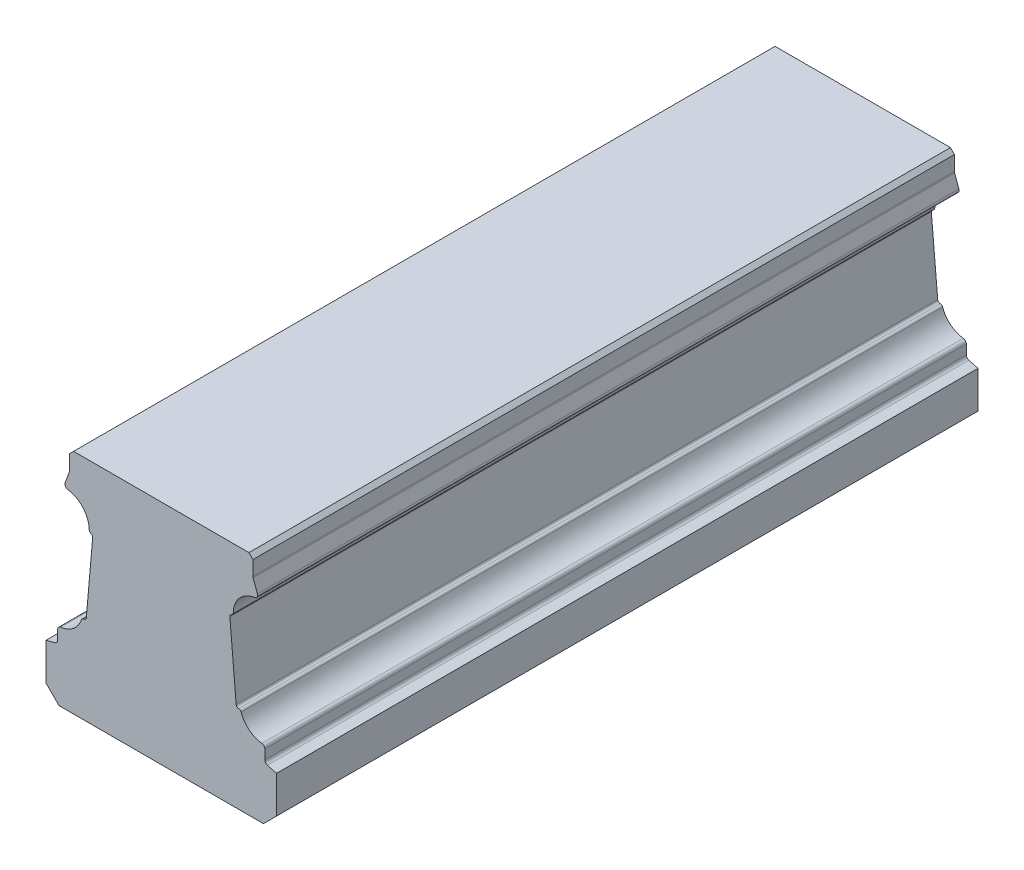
ISO-10303-21;
HEADER;
FILE_DESCRIPTION(('STEP AP214'),'2;1');
FILE_NAME('part.step','',(''),(''),'','','');
FILE_SCHEMA(('AUTOMOTIVE_DESIGN { 1 0 10303 214 1 1 1 1 }'));
ENDSEC;
DATA;
#1=APPLICATION_CONTEXT('core data for automotive mechanical design processes');
#2=APPLICATION_PROTOCOL_DEFINITION('international standard','automotive_design',2000,#1);
#3=PRODUCT_CONTEXT('',#1,'mechanical');
#4=PRODUCT('Part','Part','',(#3));
#5=PRODUCT_RELATED_PRODUCT_CATEGORY('part','',(#4));
#6=PRODUCT_DEFINITION_FORMATION('','',#4);
#7=PRODUCT_DEFINITION_CONTEXT('part definition',#1,'design');
#8=PRODUCT_DEFINITION('design','',#6,#7);
#9=PRODUCT_DEFINITION_SHAPE('','',#8);
#10=(LENGTH_UNIT() NAMED_UNIT(*) SI_UNIT(.MILLI.,.METRE.));
#11=(NAMED_UNIT(*) PLANE_ANGLE_UNIT() SI_UNIT($,.RADIAN.));
#12=(NAMED_UNIT(*) SI_UNIT($,.STERADIAN.) SOLID_ANGLE_UNIT());
#13=UNCERTAINTY_MEASURE_WITH_UNIT(LENGTH_MEASURE(1.E-05),#10,'distance_accuracy_value','');
#14=(GEOMETRIC_REPRESENTATION_CONTEXT(3) GLOBAL_UNCERTAINTY_ASSIGNED_CONTEXT((#13)) GLOBAL_UNIT_ASSIGNED_CONTEXT((#10,
#11,#12)) REPRESENTATION_CONTEXT('',''));
#15=CARTESIAN_POINT('',(0.,0.,0.));
#16=DIRECTION('',(0.,0.,1.));
#17=DIRECTION('',(1.,0.,0.));
#18=AXIS2_PLACEMENT_3D('',#15,#16,#17);
#19=CARTESIAN_POINT('',(-7.72739877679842,8.44692415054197,70.));
#20=DIRECTION('',(0.,0.,-1.));
#21=DIRECTION('',(-1.,0.,0.));
#22=AXIS2_PLACEMENT_3D('',#19,#20,#21);
#23=CYLINDRICAL_SURFACE('',#22,0.257);
#24=CARTESIAN_POINT('',(-7.72739877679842,8.44692415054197,0.));
#25=DIRECTION('',(0.,0.,1.));
#26=DIRECTION('',(1.,0.,0.));
#27=AXIS2_PLACEMENT_3D('',#24,#25,#26);
#28=CIRCLE('',#27,0.257);
#29=CARTESIAN_POINT('',(-7.73119938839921,8.70389604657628,0.));
#30=VERTEX_POINT('',#29);
#31=CARTESIAN_POINT('',(-7.97114777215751,8.52838228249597,0.));
#32=VERTEX_POINT('',#31);
#33=EDGE_CURVE('E316',#30,#32,#28,.T.);
#34=ORIENTED_EDGE('',*,*,#33,.T.);
#35=DIRECTION('',(0.,0.,-1.));
#36=VECTOR('',#35,1.);
#37=CARTESIAN_POINT('',(-7.97114777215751,8.52838228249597,70.));
#38=LINE('',#37,#36);
#39=CARTESIAN_POINT('',(-7.97114777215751,8.52838228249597,70.));
#40=VERTEX_POINT('',#39);
#41=EDGE_CURVE('E11',#40,#32,#38,.T.);
#42=ORIENTED_EDGE('',*,*,#41,.F.);
#43=CARTESIAN_POINT('',(-7.72739877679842,8.44692415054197,70.));
#44=DIRECTION('',(0.,0.,1.));
#45=DIRECTION('',(1.,0.,0.));
#46=AXIS2_PLACEMENT_3D('',#43,#44,#45);
#47=CIRCLE('',#46,0.257);
#48=CARTESIAN_POINT('',(-7.73119938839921,8.70389604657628,70.));
#49=VERTEX_POINT('',#48);
#50=EDGE_CURVE('E391',#49,#40,#47,.T.);
#51=ORIENTED_EDGE('',*,*,#50,.F.);
#52=DIRECTION('',(0.,0.,-1.));
#53=VECTOR('',#52,1.);
#54=CARTESIAN_POINT('',(-7.73119938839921,8.70389604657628,70.));
#55=LINE('',#54,#53);
#56=EDGE_CURVE('E312',#49,#30,#55,.T.);
#57=ORIENTED_EDGE('',*,*,#56,.T.);
#58=EDGE_LOOP('',(#34,#42,#51,#57));
#59=FACE_BOUND('',#58,.T.);
#60=ADVANCED_FACE('F40',(#59),#23,.T.);
#61=CARTESIAN_POINT('',(-10.31,9.31,70.));
#62=DIRECTION('',(0.,0.,-1.));
#63=DIRECTION('',(-1.,0.,0.));
#64=AXIS2_PLACEMENT_3D('',#61,#62,#63);
#65=CYLINDRICAL_SURFACE('',#64,2.466);
#66=CARTESIAN_POINT('',(-10.31,9.31,0.));
#67=DIRECTION('',(0.,0.,-1.));
#68=DIRECTION('',(-1.,0.,0.));
#69=AXIS2_PLACEMENT_3D('',#66,#67,#68);
#70=CIRCLE('',#69,2.466);
#71=CARTESIAN_POINT('',(-10.0308301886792,6.85985302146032,0.));
#72=VERTEX_POINT('',#71);
#73=EDGE_CURVE('E319',#32,#72,#70,.T.);
#74=ORIENTED_EDGE('',*,*,#73,.T.);
#75=DIRECTION('',(0.,0.,-1.));
#76=VECTOR('',#75,1.);
#77=CARTESIAN_POINT('',(-10.0308301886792,6.85985302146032,70.));
#78=LINE('',#77,#76);
#79=CARTESIAN_POINT('',(-10.0308301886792,6.85985302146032,70.));
#80=VERTEX_POINT('',#79);
#81=EDGE_CURVE('E48',#80,#72,#78,.T.);
#82=ORIENTED_EDGE('',*,*,#81,.F.);
#83=CARTESIAN_POINT('',(-10.31,9.31,70.));
#84=DIRECTION('',(0.,0.,-1.));
#85=DIRECTION('',(-1.,0.,0.));
#86=AXIS2_PLACEMENT_3D('',#83,#84,#85);
#87=CIRCLE('',#86,2.466);
#88=EDGE_CURVE('E189',#40,#80,#87,.T.);
#89=ORIENTED_EDGE('',*,*,#88,.F.);
#90=ORIENTED_EDGE('',*,*,#41,.T.);
#91=EDGE_LOOP('',(#74,#82,#89,#90));
#92=FACE_BOUND('',#91,.T.);
#93=ADVANCED_FACE('F599',(#92),#65,.F.);
#94=CARTESIAN_POINT('',(-9.992,6.5190580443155,70.));
#95=DIRECTION('',(0.,0.,-1.));
#96=DIRECTION('',(-1.,0.,0.));
#97=AXIS2_PLACEMENT_3D('',#94,#95,#96);
#98=CYLINDRICAL_SURFACE('',#97,0.343000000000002);
#99=CARTESIAN_POINT('',(-9.992,6.5190580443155,0.));
#100=DIRECTION('',(0.,0.,1.));
#101=DIRECTION('',(1.,0.,0.));
#102=AXIS2_PLACEMENT_3D('',#99,#100,#101);
#103=CIRCLE('',#102,0.343000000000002);
#104=CARTESIAN_POINT('',(-10.335,6.5190580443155,0.));
#105=VERTEX_POINT('',#104);
#106=EDGE_CURVE('E321',#72,#105,#103,.T.);
#107=ORIENTED_EDGE('',*,*,#106,.T.);
#108=DIRECTION('',(0.,0.,-1.));
#109=VECTOR('',#108,1.);
#110=CARTESIAN_POINT('',(-10.335,6.5190580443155,70.));
#111=LINE('',#110,#109);
#112=CARTESIAN_POINT('',(-10.335,6.5190580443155,70.));
#113=VERTEX_POINT('',#112);
#114=EDGE_CURVE('E488',#113,#105,#111,.T.);
#115=ORIENTED_EDGE('',*,*,#114,.F.);
#116=CARTESIAN_POINT('',(-9.992,6.5190580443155,70.));
#117=DIRECTION('',(0.,0.,1.));
#118=DIRECTION('',(1.,0.,0.));
#119=AXIS2_PLACEMENT_3D('',#116,#117,#118);
#120=CIRCLE('',#119,0.343000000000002);
#121=EDGE_CURVE('E496',#80,#113,#120,.T.);
#122=ORIENTED_EDGE('',*,*,#121,.F.);
#123=ORIENTED_EDGE('',*,*,#81,.T.);
#124=EDGE_LOOP('',(#107,#115,#122,#123));
#125=FACE_BOUND('',#124,.T.);
#126=ADVANCED_FACE('F494',(#125),#98,.T.);
#127=CARTESIAN_POINT('',(-10.335,5.57535396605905,70.));
#128=DIRECTION('',(1.,0.,0.));
#129=DIRECTION('',(0.,1.,0.));
#130=AXIS2_PLACEMENT_3D('',#127,#128,#129);
#131=PLANE('',#130);
#132=DIRECTION('',(0.,-1.,0.));
#133=VECTOR('',#132,1.);
#134=CARTESIAN_POINT('',(-10.335,5.57535396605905,0.));
#135=LINE('',#134,#133);
#136=CARTESIAN_POINT('',(-10.335,5.57535396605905,0.));
#137=VERTEX_POINT('',#136);
#138=EDGE_CURVE('E323',#105,#137,#135,.T.);
#139=ORIENTED_EDGE('',*,*,#138,.T.);
#140=DIRECTION('',(0.,0.,-1.));
#141=VECTOR('',#140,1.);
#142=CARTESIAN_POINT('',(-10.335,5.57535396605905,70.));
#143=LINE('',#142,#141);
#144=CARTESIAN_POINT('',(-10.335,5.57535396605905,70.));
#145=VERTEX_POINT('',#144);
#146=EDGE_CURVE('E485',#145,#137,#143,.T.);
#147=ORIENTED_EDGE('',*,*,#146,.F.);
#148=DIRECTION('',(0.,-1.,0.));
#149=VECTOR('',#148,1.);
#150=CARTESIAN_POINT('',(-10.335,5.57535396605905,70.));
#151=LINE('',#150,#149);
#152=EDGE_CURVE('E514',#113,#145,#151,.T.);
#153=ORIENTED_EDGE('',*,*,#152,.F.);
#154=ORIENTED_EDGE('',*,*,#114,.T.);
#155=EDGE_LOOP('',(#139,#147,#153,#154));
#156=FACE_BOUND('',#155,.T.);
#157=ADVANCED_FACE('F505',(#156),#131,.F.);
#158=CARTESIAN_POINT('',(-10.678,5.57535396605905,70.));
#159=DIRECTION('',(0.,0.,-1.));
#160=DIRECTION('',(-1.,0.,0.));
#161=AXIS2_PLACEMENT_3D('',#158,#159,#160);
#162=CYLINDRICAL_SURFACE('',#161,0.343000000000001);
#163=CARTESIAN_POINT('',(-10.678,5.57535396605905,0.));
#164=DIRECTION('',(0.,0.,-1.));
#165=DIRECTION('',(1.,0.,0.));
#166=AXIS2_PLACEMENT_3D('',#163,#164,#165);
#167=CIRCLE('',#166,0.343000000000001);
#168=CARTESIAN_POINT('',(-10.5892250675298,5.2440414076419,0.));
#169=VERTEX_POINT('',#168);
#170=EDGE_CURVE('E325',#137,#169,#167,.T.);
#171=ORIENTED_EDGE('',*,*,#170,.T.);
#172=DIRECTION('',(0.,0.,-1.));
#173=VECTOR('',#172,1.);
#174=CARTESIAN_POINT('',(-10.5892250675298,5.2440414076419,70.));
#175=LINE('',#174,#173);
#176=CARTESIAN_POINT('',(-10.5892250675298,5.2440414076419,70.));
#177=VERTEX_POINT('',#176);
#178=EDGE_CURVE('E482',#177,#169,#175,.T.);
#179=ORIENTED_EDGE('',*,*,#178,.F.);
#180=CARTESIAN_POINT('',(-10.678,5.57535396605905,70.));
#181=DIRECTION('',(0.,0.,-1.));
#182=DIRECTION('',(1.,0.,0.));
#183=AXIS2_PLACEMENT_3D('',#180,#181,#182);
#184=CIRCLE('',#183,0.343000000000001);
#185=EDGE_CURVE('E511',#145,#177,#184,.T.);
#186=ORIENTED_EDGE('',*,*,#185,.F.);
#187=ORIENTED_EDGE('',*,*,#146,.T.);
#188=EDGE_LOOP('',(#171,#179,#186,#187));
#189=FACE_BOUND('',#188,.T.);
#190=ADVANCED_FACE('F509',(#189),#162,.F.);
#191=CARTESIAN_POINT('',(-11.5,5.,70.));
#192=DIRECTION('',(0.258819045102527,-0.965925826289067,0.));
#193=DIRECTION('',(0.965925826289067,0.258819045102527,0.));
#194=AXIS2_PLACEMENT_3D('',#191,#192,#193);
#195=PLANE('',#194);
#196=DIRECTION('',(-0.965925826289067,-0.258819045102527,0.));
#197=VECTOR('',#196,1.);
#198=CARTESIAN_POINT('',(-11.5,5.,0.));
#199=LINE('',#198,#197);
#200=CARTESIAN_POINT('',(-11.5,5.,0.));
#201=VERTEX_POINT('',#200);
#202=EDGE_CURVE('E327',#169,#201,#199,.T.);
#203=ORIENTED_EDGE('',*,*,#202,.T.);
#204=DIRECTION('',(0.,0.,-1.));
#205=VECTOR('',#204,1.);
#206=CARTESIAN_POINT('',(-11.5,5.,70.));
#207=LINE('',#206,#205);
#208=CARTESIAN_POINT('',(-11.5,5.,70.));
#209=VERTEX_POINT('',#208);
#210=EDGE_CURVE('E479',#209,#201,#207,.T.);
#211=ORIENTED_EDGE('',*,*,#210,.F.);
#212=DIRECTION('',(-0.965925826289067,-0.258819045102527,0.));
#213=VECTOR('',#212,1.);
#214=CARTESIAN_POINT('',(-11.5,5.,70.));
#215=LINE('',#214,#213);
#216=EDGE_CURVE('E513',#177,#209,#215,.T.);
#217=ORIENTED_EDGE('',*,*,#216,.F.);
#218=ORIENTED_EDGE('',*,*,#178,.T.);
#219=EDGE_LOOP('',(#203,#211,#217,#218));
#220=FACE_BOUND('',#219,.T.);
#221=ADVANCED_FACE('F612',(#220),#195,.F.);
#222=CARTESIAN_POINT('',(-11.5,5.,70.));
#223=DIRECTION('',(1.,0.,0.));
#224=DIRECTION('',(0.,1.,0.));
#225=AXIS2_PLACEMENT_3D('',#222,#223,#224);
#226=PLANE('',#225);
#227=DIRECTION('',(0.,-1.,0.));
#228=VECTOR('',#227,1.);
#229=CARTESIAN_POINT('',(-11.5,5.,0.));
#230=LINE('',#229,#228);
#231=CARTESIAN_POINT('',(-11.5,1.3,0.));
#232=VERTEX_POINT('',#231);
#233=EDGE_CURVE('E329',#201,#232,#230,.T.);
#234=ORIENTED_EDGE('',*,*,#233,.T.);
#235=DIRECTION('',(0.,0.,-1.));
#236=VECTOR('',#235,1.);
#237=CARTESIAN_POINT('',(-11.5,1.3,70.));
#238=LINE('',#237,#236);
#239=CARTESIAN_POINT('',(-11.5,1.3,70.));
#240=VERTEX_POINT('',#239);
#241=EDGE_CURVE('E476',#240,#232,#238,.T.);
#242=ORIENTED_EDGE('',*,*,#241,.F.);
#243=DIRECTION('',(0.,-1.,0.));
#244=VECTOR('',#243,1.);
#245=CARTESIAN_POINT('',(-11.5,5.,70.));
#246=LINE('',#245,#244);
#247=EDGE_CURVE('E516',#209,#240,#246,.T.);
#248=ORIENTED_EDGE('',*,*,#247,.F.);
#249=ORIENTED_EDGE('',*,*,#210,.T.);
#250=EDGE_LOOP('',(#234,#242,#248,#249));
#251=FACE_BOUND('',#250,.T.);
#252=ADVANCED_FACE('F615',(#251),#226,.F.);
#253=CARTESIAN_POINT('',(-11.5,1.3,70.));
#254=DIRECTION('',(0.707106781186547,0.707106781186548,0.));
#255=DIRECTION('',(-0.707106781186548,0.707106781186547,0.));
#256=AXIS2_PLACEMENT_3D('',#253,#254,#255);
#257=PLANE('',#256);
#258=DIRECTION('',(0.707106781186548,-0.707106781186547,0.));
#259=VECTOR('',#258,1.);
#260=CARTESIAN_POINT('',(-11.5,1.3,0.));
#261=LINE('',#260,#259);
#262=CARTESIAN_POINT('',(-10.2,0.,0.));
#263=VERTEX_POINT('',#262);
#264=EDGE_CURVE('E331',#232,#263,#261,.T.);
#265=ORIENTED_EDGE('',*,*,#264,.T.);
#266=DIRECTION('',(0.,0.,-1.));
#267=VECTOR('',#266,1.);
#268=CARTESIAN_POINT('',(-10.2,0.,70.));
#269=LINE('',#268,#267);
#270=CARTESIAN_POINT('',(-10.2,0.,70.));
#271=VERTEX_POINT('',#270);
#272=EDGE_CURVE('E473',#271,#263,#269,.T.);
#273=ORIENTED_EDGE('',*,*,#272,.F.);
#274=DIRECTION('',(0.707106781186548,-0.707106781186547,0.));
#275=VECTOR('',#274,1.);
#276=CARTESIAN_POINT('',(-11.5,1.3,70.));
#277=LINE('',#276,#275);
#278=EDGE_CURVE('E522',#240,#271,#277,.T.);
#279=ORIENTED_EDGE('',*,*,#278,.F.);
#280=ORIENTED_EDGE('',*,*,#241,.T.);
#281=EDGE_LOOP('',(#265,#273,#279,#280));
#282=FACE_BOUND('',#281,.T.);
#283=ADVANCED_FACE('F619',(#282),#257,.F.);
#284=CARTESIAN_POINT('',(-10.2,0.,70.));
#285=DIRECTION('',(0.,1.,0.));
#286=DIRECTION('',(-1.,0.,0.));
#287=AXIS2_PLACEMENT_3D('',#284,#285,#286);
#288=PLANE('',#287);
#289=DIRECTION('',(1.,0.,0.));
#290=VECTOR('',#289,1.);
#291=CARTESIAN_POINT('',(-10.2,0.,0.));
#292=LINE('',#291,#290);
#293=CARTESIAN_POINT('',(10.2,0.,0.));
#294=VERTEX_POINT('',#293);
#295=EDGE_CURVE('E333',#263,#294,#292,.T.);
#296=ORIENTED_EDGE('',*,*,#295,.T.);
#297=DIRECTION('',(0.,0.,-1.));
#298=VECTOR('',#297,1.);
#299=CARTESIAN_POINT('',(10.2,0.,70.));
#300=LINE('',#299,#298);
#301=CARTESIAN_POINT('',(10.2,0.,70.));
#302=VERTEX_POINT('',#301);
#303=EDGE_CURVE('E470',#302,#294,#300,.T.);
#304=ORIENTED_EDGE('',*,*,#303,.F.);
#305=DIRECTION('',(1.,0.,0.));
#306=VECTOR('',#305,1.);
#307=CARTESIAN_POINT('',(-10.2,0.,70.));
#308=LINE('',#307,#306);
#309=EDGE_CURVE('E524',#271,#302,#308,.T.);
#310=ORIENTED_EDGE('',*,*,#309,.F.);
#311=ORIENTED_EDGE('',*,*,#272,.T.);
#312=EDGE_LOOP('',(#296,#304,#310,#311));
#313=FACE_BOUND('',#312,.T.);
#314=ADVANCED_FACE('F623',(#313),#288,.F.);
#315=CARTESIAN_POINT('',(10.2,0.,70.));
#316=DIRECTION('',(-0.707106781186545,0.70710678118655,0.));
#317=DIRECTION('',(-0.70710678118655,-0.707106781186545,0.));
#318=AXIS2_PLACEMENT_3D('',#315,#316,#317);
#319=PLANE('',#318);
#320=DIRECTION('',(0.70710678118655,0.707106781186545,0.));
#321=VECTOR('',#320,1.);
#322=CARTESIAN_POINT('',(10.2,0.,0.));
#323=LINE('',#322,#321);
#324=CARTESIAN_POINT('',(11.5,1.3,0.));
#325=VERTEX_POINT('',#324);
#326=EDGE_CURVE('E335',#294,#325,#323,.T.);
#327=ORIENTED_EDGE('',*,*,#326,.T.);
#328=DIRECTION('',(0.,0.,-1.));
#329=VECTOR('',#328,1.);
#330=CARTESIAN_POINT('',(11.5,1.3,70.));
#331=LINE('',#330,#329);
#332=CARTESIAN_POINT('',(11.5,1.3,70.));
#333=VERTEX_POINT('',#332);
#334=EDGE_CURVE('E467',#333,#325,#331,.T.);
#335=ORIENTED_EDGE('',*,*,#334,.F.);
#336=DIRECTION('',(0.70710678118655,0.707106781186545,0.));
#337=VECTOR('',#336,1.);
#338=CARTESIAN_POINT('',(10.2,0.,70.));
#339=LINE('',#338,#337);
#340=EDGE_CURVE('E526',#302,#333,#339,.T.);
#341=ORIENTED_EDGE('',*,*,#340,.F.);
#342=ORIENTED_EDGE('',*,*,#303,.T.);
#343=EDGE_LOOP('',(#327,#335,#341,#342));
#344=FACE_BOUND('',#343,.T.);
#345=ADVANCED_FACE('F627',(#344),#319,.F.);
#346=CARTESIAN_POINT('',(11.5,1.3,70.));
#347=DIRECTION('',(-1.,0.,0.));
#348=DIRECTION('',(0.,-1.,0.));
#349=AXIS2_PLACEMENT_3D('',#346,#347,#348);
#350=PLANE('',#349);
#351=DIRECTION('',(0.,1.,0.));
#352=VECTOR('',#351,1.);
#353=CARTESIAN_POINT('',(11.5,1.3,0.));
#354=LINE('',#353,#352);
#355=CARTESIAN_POINT('',(11.5,5.,0.));
#356=VERTEX_POINT('',#355);
#357=EDGE_CURVE('E337',#325,#356,#354,.T.);
#358=ORIENTED_EDGE('',*,*,#357,.T.);
#359=DIRECTION('',(0.,0.,-1.));
#360=VECTOR('',#359,1.);
#361=CARTESIAN_POINT('',(11.5,5.,70.));
#362=LINE('',#361,#360);
#363=CARTESIAN_POINT('',(11.5,5.,70.));
#364=VERTEX_POINT('',#363);
#365=EDGE_CURVE('E464',#364,#356,#362,.T.);
#366=ORIENTED_EDGE('',*,*,#365,.F.);
#367=DIRECTION('',(0.,1.,0.));
#368=VECTOR('',#367,1.);
#369=CARTESIAN_POINT('',(11.5,1.3,70.));
#370=LINE('',#369,#368);
#371=EDGE_CURVE('E528',#333,#364,#370,.T.);
#372=ORIENTED_EDGE('',*,*,#371,.F.);
#373=ORIENTED_EDGE('',*,*,#334,.T.);
#374=EDGE_LOOP('',(#358,#366,#372,#373));
#375=FACE_BOUND('',#374,.T.);
#376=ADVANCED_FACE('F631',(#375),#350,.F.);
#377=CARTESIAN_POINT('',(10.5892250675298,5.2440414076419,70.));
#378=DIRECTION('',(-0.258819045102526,-0.965925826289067,0.));
#379=DIRECTION('',(0.965925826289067,-0.258819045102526,0.));
#380=AXIS2_PLACEMENT_3D('',#377,#378,#379);
#381=PLANE('',#380);
#382=DIRECTION('',(-0.965925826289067,0.258819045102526,0.));
#383=VECTOR('',#382,1.);
#384=CARTESIAN_POINT('',(10.5892250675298,5.2440414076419,0.));
#385=LINE('',#384,#383);
#386=CARTESIAN_POINT('',(10.5892250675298,5.2440414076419,0.));
#387=VERTEX_POINT('',#386);
#388=EDGE_CURVE('E339',#356,#387,#385,.T.);
#389=ORIENTED_EDGE('',*,*,#388,.T.);
#390=DIRECTION('',(0.,0.,-1.));
#391=VECTOR('',#390,1.);
#392=CARTESIAN_POINT('',(10.5892250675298,5.2440414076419,70.));
#393=LINE('',#392,#391);
#394=CARTESIAN_POINT('',(10.5892250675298,5.2440414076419,70.));
#395=VERTEX_POINT('',#394);
#396=EDGE_CURVE('E461',#395,#387,#393,.T.);
#397=ORIENTED_EDGE('',*,*,#396,.F.);
#398=DIRECTION('',(-0.965925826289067,0.258819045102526,0.));
#399=VECTOR('',#398,1.);
#400=CARTESIAN_POINT('',(10.5892250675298,5.2440414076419,70.));
#401=LINE('',#400,#399);
#402=EDGE_CURVE('E530',#364,#395,#401,.T.);
#403=ORIENTED_EDGE('',*,*,#402,.F.);
#404=ORIENTED_EDGE('',*,*,#365,.T.);
#405=EDGE_LOOP('',(#389,#397,#403,#404));
#406=FACE_BOUND('',#405,.T.);
#407=ADVANCED_FACE('F635',(#406),#381,.F.);
#408=CARTESIAN_POINT('',(10.678,5.57535396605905,70.));
#409=DIRECTION('',(0.,0.,-1.));
#410=DIRECTION('',(-1.,0.,0.));
#411=AXIS2_PLACEMENT_3D('',#408,#409,#410);
#412=CYLINDRICAL_SURFACE('',#411,0.343);
#413=CARTESIAN_POINT('',(10.678,5.57535396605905,0.));
#414=DIRECTION('',(0.,0.,-1.));
#415=DIRECTION('',(1.,0.,0.));
#416=AXIS2_PLACEMENT_3D('',#413,#414,#415);
#417=CIRCLE('',#416,0.343);
#418=CARTESIAN_POINT('',(10.335,5.57535396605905,0.));
#419=VERTEX_POINT('',#418);
#420=EDGE_CURVE('E341',#387,#419,#417,.T.);
#421=ORIENTED_EDGE('',*,*,#420,.T.);
#422=DIRECTION('',(0.,0.,-1.));
#423=VECTOR('',#422,1.);
#424=CARTESIAN_POINT('',(10.335,5.57535396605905,70.));
#425=LINE('',#424,#423);
#426=CARTESIAN_POINT('',(10.335,5.57535396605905,70.));
#427=VERTEX_POINT('',#426);
#428=EDGE_CURVE('E458',#427,#419,#425,.T.);
#429=ORIENTED_EDGE('',*,*,#428,.F.);
#430=CARTESIAN_POINT('',(10.678,5.57535396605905,70.));
#431=DIRECTION('',(0.,0.,-1.));
#432=DIRECTION('',(1.,0.,0.));
#433=AXIS2_PLACEMENT_3D('',#430,#431,#432);
#434=CIRCLE('',#433,0.343);
#435=EDGE_CURVE('E532',#395,#427,#434,.T.);
#436=ORIENTED_EDGE('',*,*,#435,.F.);
#437=ORIENTED_EDGE('',*,*,#396,.T.);
#438=EDGE_LOOP('',(#421,#429,#436,#437));
#439=FACE_BOUND('',#438,.T.);
#440=ADVANCED_FACE('F639',(#439),#412,.F.);
#441=CARTESIAN_POINT('',(10.335,6.5190580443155,70.));
#442=DIRECTION('',(-1.,0.,0.));
#443=DIRECTION('',(0.,-1.,0.));
#444=AXIS2_PLACEMENT_3D('',#441,#442,#443);
#445=PLANE('',#444);
#446=DIRECTION('',(0.,1.,0.));
#447=VECTOR('',#446,1.);
#448=CARTESIAN_POINT('',(10.335,6.5190580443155,0.));
#449=LINE('',#448,#447);
#450=CARTESIAN_POINT('',(10.335,6.5190580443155,0.));
#451=VERTEX_POINT('',#450);
#452=EDGE_CURVE('E343',#419,#451,#449,.T.);
#453=ORIENTED_EDGE('',*,*,#452,.T.);
#454=DIRECTION('',(0.,0.,-1.));
#455=VECTOR('',#454,1.);
#456=CARTESIAN_POINT('',(10.335,6.5190580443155,70.));
#457=LINE('',#456,#455);
#458=CARTESIAN_POINT('',(10.335,6.5190580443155,70.));
#459=VERTEX_POINT('',#458);
#460=EDGE_CURVE('E455',#459,#451,#457,.T.);
#461=ORIENTED_EDGE('',*,*,#460,.F.);
#462=DIRECTION('',(0.,1.,0.));
#463=VECTOR('',#462,1.);
#464=CARTESIAN_POINT('',(10.335,6.5190580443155,70.));
#465=LINE('',#464,#463);
#466=EDGE_CURVE('E534',#427,#459,#465,.T.);
#467=ORIENTED_EDGE('',*,*,#466,.F.);
#468=ORIENTED_EDGE('',*,*,#428,.T.);
#469=EDGE_LOOP('',(#453,#461,#467,#468));
#470=FACE_BOUND('',#469,.T.);
#471=ADVANCED_FACE('F643',(#470),#445,.F.);
#472=CARTESIAN_POINT('',(9.992,6.5190580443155,70.));
#473=DIRECTION('',(0.,0.,-1.));
#474=DIRECTION('',(-1.,0.,0.));
#475=AXIS2_PLACEMENT_3D('',#472,#473,#474);
#476=CYLINDRICAL_SURFACE('',#475,0.343000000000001);
#477=CARTESIAN_POINT('',(9.992,6.5190580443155,0.));
#478=DIRECTION('',(0.,0.,1.));
#479=DIRECTION('',(1.,0.,0.));
#480=AXIS2_PLACEMENT_3D('',#477,#478,#479);
#481=CIRCLE('',#480,0.343000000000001);
#482=CARTESIAN_POINT('',(10.0308301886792,6.85985302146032,0.));
#483=VERTEX_POINT('',#482);
#484=EDGE_CURVE('E345',#451,#483,#481,.T.);
#485=ORIENTED_EDGE('',*,*,#484,.T.);
#486=DIRECTION('',(0.,0.,-1.));
#487=VECTOR('',#486,1.);
#488=CARTESIAN_POINT('',(10.0308301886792,6.85985302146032,70.));
#489=LINE('',#488,#487);
#490=CARTESIAN_POINT('',(10.0308301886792,6.85985302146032,70.));
#491=VERTEX_POINT('',#490);
#492=EDGE_CURVE('E452',#491,#483,#489,.T.);
#493=ORIENTED_EDGE('',*,*,#492,.F.);
#494=CARTESIAN_POINT('',(9.992,6.5190580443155,70.));
#495=DIRECTION('',(0.,0.,1.));
#496=DIRECTION('',(1.,0.,0.));
#497=AXIS2_PLACEMENT_3D('',#494,#495,#496);
#498=CIRCLE('',#497,0.343000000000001);
#499=EDGE_CURVE('E536',#459,#491,#498,.T.);
#500=ORIENTED_EDGE('',*,*,#499,.F.);
#501=ORIENTED_EDGE('',*,*,#460,.T.);
#502=EDGE_LOOP('',(#485,#493,#500,#501));
#503=FACE_BOUND('',#502,.T.);
#504=ADVANCED_FACE('F647',(#503),#476,.T.);
#505=CARTESIAN_POINT('',(10.31,9.31,70.));
#506=DIRECTION('',(0.,0.,-1.));
#507=DIRECTION('',(-1.,0.,0.));
#508=AXIS2_PLACEMENT_3D('',#505,#506,#507);
#509=CYLINDRICAL_SURFACE('',#508,2.466);
#510=CARTESIAN_POINT('',(10.31,9.31,0.));
#511=DIRECTION('',(0.,0.,-1.));
#512=DIRECTION('',(-1.,0.,0.));
#513=AXIS2_PLACEMENT_3D('',#510,#511,#512);
#514=CIRCLE('',#513,2.466);
#515=CARTESIAN_POINT('',(7.97114777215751,8.52838228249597,0.));
#516=VERTEX_POINT('',#515);
#517=EDGE_CURVE('E347',#483,#516,#514,.T.);
#518=ORIENTED_EDGE('',*,*,#517,.T.);
#519=DIRECTION('',(0.,0.,-1.));
#520=VECTOR('',#519,1.);
#521=CARTESIAN_POINT('',(7.97114777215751,8.52838228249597,70.));
#522=LINE('',#521,#520);
#523=CARTESIAN_POINT('',(7.97114777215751,8.52838228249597,70.));
#524=VERTEX_POINT('',#523);
#525=EDGE_CURVE('E449',#524,#516,#522,.T.);
#526=ORIENTED_EDGE('',*,*,#525,.F.);
#527=CARTESIAN_POINT('',(10.31,9.31,70.));
#528=DIRECTION('',(0.,0.,-1.));
#529=DIRECTION('',(-1.,0.,0.));
#530=AXIS2_PLACEMENT_3D('',#527,#528,#529);
#531=CIRCLE('',#530,2.466);
#532=EDGE_CURVE('E538',#491,#524,#531,.T.);
#533=ORIENTED_EDGE('',*,*,#532,.F.);
#534=ORIENTED_EDGE('',*,*,#492,.T.);
#535=EDGE_LOOP('',(#518,#526,#533,#534));
#536=FACE_BOUND('',#535,.T.);
#537=ADVANCED_FACE('F651',(#536),#509,.F.);
#538=CARTESIAN_POINT('',(7.72739877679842,8.44692415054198,70.));
#539=DIRECTION('',(0.,0.,-1.));
#540=DIRECTION('',(-1.,0.,0.));
#541=AXIS2_PLACEMENT_3D('',#538,#539,#540);
#542=CYLINDRICAL_SURFACE('',#541,0.257);
#543=CARTESIAN_POINT('',(7.72739877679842,8.44692415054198,0.));
#544=DIRECTION('',(0.,0.,1.));
#545=DIRECTION('',(1.,0.,0.));
#546=AXIS2_PLACEMENT_3D('',#543,#544,#545);
#547=CIRCLE('',#546,0.257);
#548=CARTESIAN_POINT('',(7.73119938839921,8.70389604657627,0.));
#549=VERTEX_POINT('',#548);
#550=EDGE_CURVE('E349',#516,#549,#547,.T.);
#551=ORIENTED_EDGE('',*,*,#550,.T.);
#552=DIRECTION('',(0.,0.,-1.));
#553=VECTOR('',#552,1.);
#554=CARTESIAN_POINT('',(7.73119938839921,8.70389604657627,70.));
#555=LINE('',#554,#553);
#556=CARTESIAN_POINT('',(7.73119938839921,8.70389604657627,70.));
#557=VERTEX_POINT('',#556);
#558=EDGE_CURVE('E446',#557,#549,#555,.T.);
#559=ORIENTED_EDGE('',*,*,#558,.F.);
#560=CARTESIAN_POINT('',(7.72739877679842,8.44692415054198,70.));
#561=DIRECTION('',(0.,0.,1.));
#562=DIRECTION('',(1.,0.,0.));
#563=AXIS2_PLACEMENT_3D('',#560,#561,#562);
#564=CIRCLE('',#563,0.257);
#565=EDGE_CURVE('E540',#524,#557,#564,.T.);
#566=ORIENTED_EDGE('',*,*,#565,.F.);
#567=ORIENTED_EDGE('',*,*,#525,.T.);
#568=EDGE_LOOP('',(#551,#559,#566,#567));
#569=FACE_BOUND('',#568,.T.);
#570=ADVANCED_FACE('F655',(#569),#542,.T.);
#571=CARTESIAN_POINT('',(7.735,8.96086794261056,70.));
#572=DIRECTION('',(0.,0.,-1.));
#573=DIRECTION('',(-1.,0.,0.));
#574=AXIS2_PLACEMENT_3D('',#571,#572,#573);
#575=CYLINDRICAL_SURFACE('',#574,0.25699999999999);
#576=CARTESIAN_POINT('',(7.735,8.96086794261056,0.));
#577=DIRECTION('',(0.,0.,-1.));
#578=DIRECTION('',(-1.,0.,0.));
#579=AXIS2_PLACEMENT_3D('',#576,#577,#578);
#580=CIRCLE('',#579,0.25699999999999);
#581=CARTESIAN_POINT('',(7.4789779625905,8.9384689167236,0.));
#582=VERTEX_POINT('',#581);
#583=EDGE_CURVE('E351',#549,#582,#580,.T.);
#584=ORIENTED_EDGE('',*,*,#583,.T.);
#585=DIRECTION('',(0.,0.,-1.));
#586=VECTOR('',#585,1.);
#587=CARTESIAN_POINT('',(7.4789779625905,8.9384689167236,70.));
#588=LINE('',#587,#586);
#589=CARTESIAN_POINT('',(7.4789779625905,8.9384689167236,70.));
#590=VERTEX_POINT('',#589);
#591=EDGE_CURVE('E443',#590,#582,#588,.T.);
#592=ORIENTED_EDGE('',*,*,#591,.F.);
#593=CARTESIAN_POINT('',(7.735,8.96086794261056,70.));
#594=DIRECTION('',(0.,0.,-1.));
#595=DIRECTION('',(-1.,0.,0.));
#596=AXIS2_PLACEMENT_3D('',#593,#594,#595);
#597=CIRCLE('',#596,0.25699999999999);
#598=EDGE_CURVE('E542',#557,#590,#597,.T.);
#599=ORIENTED_EDGE('',*,*,#598,.F.);
#600=ORIENTED_EDGE('',*,*,#558,.T.);
#601=EDGE_LOOP('',(#584,#592,#599,#600));
#602=FACE_BOUND('',#601,.T.);
#603=ADVANCED_FACE('F659',(#602),#575,.F.);
#604=CARTESIAN_POINT('',(7.47897796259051,8.9384689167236,70.));
#605=DIRECTION('',(-0.996194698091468,-0.0871557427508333,0.));
#606=DIRECTION('',(0.0871557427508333,-0.996194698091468,0.));
#607=AXIS2_PLACEMENT_3D('',#604,#605,#606);
#608=PLANE('',#607);
#609=DIRECTION('',(-0.0871557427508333,0.996194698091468,0.));
#610=VECTOR('',#609,1.);
#611=CARTESIAN_POINT('',(7.47897796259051,8.9384689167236,0.));
#612=LINE('',#611,#610);
#613=CARTESIAN_POINT('',(6.84397796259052,16.1965521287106,0.));
#614=VERTEX_POINT('',#613);
#615=EDGE_CURVE('E353',#582,#614,#612,.T.);
#616=ORIENTED_EDGE('',*,*,#615,.T.);
#617=DIRECTION('',(0.,0.,-1.));
#618=VECTOR('',#617,1.);
#619=CARTESIAN_POINT('',(6.84397796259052,16.1965521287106,70.));
#620=LINE('',#619,#618);
#621=CARTESIAN_POINT('',(6.84397796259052,16.1965521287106,70.));
#622=VERTEX_POINT('',#621);
#623=EDGE_CURVE('E440',#622,#614,#620,.T.);
#624=ORIENTED_EDGE('',*,*,#623,.F.);
#625=DIRECTION('',(-0.0871557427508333,0.996194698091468,0.));
#626=VECTOR('',#625,1.);
#627=CARTESIAN_POINT('',(7.47897796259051,8.9384689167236,70.));
#628=LINE('',#627,#626);
#629=EDGE_CURVE('E544',#590,#622,#628,.T.);
#630=ORIENTED_EDGE('',*,*,#629,.F.);
#631=ORIENTED_EDGE('',*,*,#591,.T.);
#632=EDGE_LOOP('',(#616,#624,#630,#631));
#633=FACE_BOUND('',#632,.T.);
#634=ADVANCED_FACE('F663',(#633),#608,.F.);
#635=CARTESIAN_POINT('',(7.09999999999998,16.2189511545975,70.));
#636=DIRECTION('',(0.,0.,-1.));
#637=DIRECTION('',(-1.,0.,0.));
#638=AXIS2_PLACEMENT_3D('',#635,#636,#637);
#639=CYLINDRICAL_SURFACE('',#638,0.256999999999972);
#640=CARTESIAN_POINT('',(7.09999999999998,16.2189511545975,0.));
#641=DIRECTION('',(0.,0.,-1.));
#642=DIRECTION('',(-1.,0.,0.));
#643=AXIS2_PLACEMENT_3D('',#640,#641,#642);
#644=CIRCLE('',#643,0.256999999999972);
#645=CARTESIAN_POINT('',(7.01367043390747,16.4610176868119,0.));
#646=VERTEX_POINT('',#645);
#647=EDGE_CURVE('E355',#614,#646,#644,.T.);
#648=ORIENTED_EDGE('',*,*,#647,.T.);
#649=DIRECTION('',(0.,0.,-1.));
#650=VECTOR('',#649,1.);
#651=CARTESIAN_POINT('',(7.01367043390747,16.4610176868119,70.));
#652=LINE('',#651,#650);
#653=CARTESIAN_POINT('',(7.01367043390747,16.4610176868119,70.));
#654=VERTEX_POINT('',#653);
#655=EDGE_CURVE('E437',#654,#646,#652,.T.);
#656=ORIENTED_EDGE('',*,*,#655,.F.);
#657=CARTESIAN_POINT('',(7.09999999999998,16.2189511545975,70.));
#658=DIRECTION('',(0.,0.,-1.));
#659=DIRECTION('',(-1.,0.,0.));
#660=AXIS2_PLACEMENT_3D('',#657,#658,#659);
#661=CIRCLE('',#660,0.256999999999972);
#662=EDGE_CURVE('E546',#622,#654,#661,.T.);
#663=ORIENTED_EDGE('',*,*,#662,.F.);
#664=ORIENTED_EDGE('',*,*,#623,.T.);
#665=EDGE_LOOP('',(#648,#656,#663,#664));
#666=FACE_BOUND('',#665,.T.);
#667=ADVANCED_FACE('F667',(#666),#639,.F.);
#668=CARTESIAN_POINT('',(6.92734086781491,16.7030842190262,70.));
#669=DIRECTION('',(0.,0.,-1.));
#670=DIRECTION('',(-1.,0.,0.));
#671=AXIS2_PLACEMENT_3D('',#668,#669,#670);
#672=CYLINDRICAL_SURFACE('',#671,0.257000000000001);
#673=CARTESIAN_POINT('',(6.92734086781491,16.7030842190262,0.));
#674=DIRECTION('',(0.,0.,1.));
#675=DIRECTION('',(1.,0.,0.));
#676=AXIS2_PLACEMENT_3D('',#673,#674,#675);
#677=CIRCLE('',#676,0.257000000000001);
#678=CARTESIAN_POINT('',(7.18430869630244,16.6990178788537,0.));
#679=VERTEX_POINT('',#678);
#680=EDGE_CURVE('E357',#646,#679,#677,.T.);
#681=ORIENTED_EDGE('',*,*,#680,.T.);
#682=DIRECTION('',(0.,0.,-1.));
#683=VECTOR('',#682,1.);
#684=CARTESIAN_POINT('',(7.18430869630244,16.6990178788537,70.));
#685=LINE('',#684,#683);
#686=CARTESIAN_POINT('',(7.18430869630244,16.6990178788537,70.));
#687=VERTEX_POINT('',#686);
#688=EDGE_CURVE('E434',#687,#679,#685,.T.);
#689=ORIENTED_EDGE('',*,*,#688,.F.);
#690=CARTESIAN_POINT('',(6.92734086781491,16.7030842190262,70.));
#691=DIRECTION('',(0.,0.,1.));
#692=DIRECTION('',(1.,0.,0.));
#693=AXIS2_PLACEMENT_3D('',#690,#691,#692);
#694=CIRCLE('',#693,0.257000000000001);
#695=EDGE_CURVE('E548',#654,#687,#694,.T.);
#696=ORIENTED_EDGE('',*,*,#695,.F.);
#697=ORIENTED_EDGE('',*,*,#655,.T.);
#698=EDGE_LOOP('',(#681,#689,#696,#697));
#699=FACE_BOUND('',#698,.T.);
#700=ADVANCED_FACE('F671',(#699),#672,.T.);
#701=CARTESIAN_POINT('',(9.65,16.66,70.));
#702=DIRECTION('',(0.,0.,-1.));
#703=DIRECTION('',(-1.,0.,0.));
#704=AXIS2_PLACEMENT_3D('',#701,#702,#703);
#705=CYLINDRICAL_SURFACE('',#704,2.466);
#706=CARTESIAN_POINT('',(9.65,16.66,0.));
#707=DIRECTION('',(0.,0.,-1.));
#708=DIRECTION('',(-1.,0.,0.));
#709=AXIS2_PLACEMENT_3D('',#706,#707,#708);
#710=CIRCLE('',#709,2.466);
#711=CARTESIAN_POINT('',(9.31671298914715,19.1033738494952,0.));
#712=VERTEX_POINT('',#711);
#713=EDGE_CURVE('E359',#679,#712,#710,.T.);
#714=ORIENTED_EDGE('',*,*,#713,.T.);
#715=DIRECTION('',(0.,0.,-1.));
#716=VECTOR('',#715,1.);
#717=CARTESIAN_POINT('',(9.31671298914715,19.1033738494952,70.));
#718=LINE('',#717,#716);
#719=CARTESIAN_POINT('',(9.31671298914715,19.1033738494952,70.));
#720=VERTEX_POINT('',#719);
#721=EDGE_CURVE('E431',#720,#712,#718,.T.);
#722=ORIENTED_EDGE('',*,*,#721,.F.);
#723=CARTESIAN_POINT('',(9.65,16.66,70.));
#724=DIRECTION('',(0.,0.,-1.));
#725=DIRECTION('',(-1.,0.,0.));
#726=AXIS2_PLACEMENT_3D('',#723,#724,#725);
#727=CIRCLE('',#726,2.466);
#728=EDGE_CURVE('E550',#687,#720,#727,.T.);
#729=ORIENTED_EDGE('',*,*,#728,.F.);
#730=ORIENTED_EDGE('',*,*,#688,.T.);
#731=EDGE_LOOP('',(#714,#722,#729,#730));
#732=FACE_BOUND('',#731,.T.);
#733=ADVANCED_FACE('F675',(#732),#705,.F.);
#734=CARTESIAN_POINT('',(9.27035555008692,19.4432267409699,70.));
#735=DIRECTION('',(0.,0.,-1.));
#736=DIRECTION('',(-1.,0.,0.));
#737=AXIS2_PLACEMENT_3D('',#734,#735,#736);
#738=CYLINDRICAL_SURFACE('',#737,0.343);
#739=CARTESIAN_POINT('',(9.27035555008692,19.4432267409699,0.));
#740=DIRECTION('',(0.,0.,1.));
#741=DIRECTION('',(-1.,0.,0.));
#742=AXIS2_PLACEMENT_3D('',#739,#740,#741);
#743=CIRCLE('',#742,0.343);
#744=CARTESIAN_POINT('',(9.59267011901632,19.5605396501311,0.));
#745=VERTEX_POINT('',#744);
#746=EDGE_CURVE('E361',#712,#745,#743,.T.);
#747=ORIENTED_EDGE('',*,*,#746,.T.);
#748=DIRECTION('',(0.,0.,-1.));
#749=VECTOR('',#748,1.);
#750=CARTESIAN_POINT('',(9.59267011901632,19.5605396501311,70.));
#751=LINE('',#750,#749);
#752=CARTESIAN_POINT('',(9.59267011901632,19.5605396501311,70.));
#753=VERTEX_POINT('',#752);
#754=EDGE_CURVE('E428',#753,#745,#751,.T.);
#755=ORIENTED_EDGE('',*,*,#754,.F.);
#756=CARTESIAN_POINT('',(9.27035555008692,19.4432267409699,70.));
#757=DIRECTION('',(0.,0.,1.));
#758=DIRECTION('',(-1.,0.,0.));
#759=AXIS2_PLACEMENT_3D('',#756,#757,#758);
#760=CIRCLE('',#759,0.343);
#761=EDGE_CURVE('E552',#720,#753,#760,.T.);
#762=ORIENTED_EDGE('',*,*,#761,.F.);
#763=ORIENTED_EDGE('',*,*,#721,.T.);
#764=EDGE_LOOP('',(#747,#755,#762,#763));
#765=FACE_BOUND('',#764,.T.);
#766=ADVANCED_FACE('F679',(#765),#738,.T.);
#767=CARTESIAN_POINT('',(9.59267011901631,19.5605396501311,70.));
#768=DIRECTION('',(-0.93969262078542,-0.34202014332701,0.));
#769=DIRECTION('',(0.34202014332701,-0.93969262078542,0.));
#770=AXIS2_PLACEMENT_3D('',#767,#768,#769);
#771=PLANE('',#770);
#772=DIRECTION('',(-0.34202014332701,0.93969262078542,0.));
#773=VECTOR('',#772,1.);
#774=CARTESIAN_POINT('',(9.59267011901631,19.5605396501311,0.));
#775=LINE('',#774,#773);
#776=CARTESIAN_POINT('',(9.1706854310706,20.7199330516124,0.));
#777=VERTEX_POINT('',#776);
#778=EDGE_CURVE('E363',#745,#777,#775,.T.);
#779=ORIENTED_EDGE('',*,*,#778,.T.);
#780=DIRECTION('',(0.,0.,-1.));
#781=VECTOR('',#780,1.);
#782=CARTESIAN_POINT('',(9.1706854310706,20.7199330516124,70.));
#783=LINE('',#782,#781);
#784=CARTESIAN_POINT('',(9.1706854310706,20.7199330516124,70.));
#785=VERTEX_POINT('',#784);
#786=EDGE_CURVE('E425',#785,#777,#783,.T.);
#787=ORIENTED_EDGE('',*,*,#786,.F.);
#788=DIRECTION('',(-0.34202014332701,0.93969262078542,0.));
#789=VECTOR('',#788,1.);
#790=CARTESIAN_POINT('',(9.59267011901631,19.5605396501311,70.));
#791=LINE('',#790,#789);
#792=EDGE_CURVE('E554',#753,#785,#791,.T.);
#793=ORIENTED_EDGE('',*,*,#792,.F.);
#794=ORIENTED_EDGE('',*,*,#754,.T.);
#795=EDGE_LOOP('',(#779,#787,#793,#794));
#796=FACE_BOUND('',#795,.T.);
#797=ADVANCED_FACE('F683',(#796),#771,.F.);
#798=CARTESIAN_POINT('',(9.493,20.8372459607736,70.));
#799=DIRECTION('',(0.,0.,-1.));
#800=DIRECTION('',(-1.,0.,0.));
#801=AXIS2_PLACEMENT_3D('',#798,#799,#800);
#802=CYLINDRICAL_SURFACE('',#801,0.343);
#803=CARTESIAN_POINT('',(9.493,20.8372459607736,0.));
#804=DIRECTION('',(0.,0.,-1.));
#805=DIRECTION('',(-1.,0.,0.));
#806=AXIS2_PLACEMENT_3D('',#803,#804,#805);
#807=CIRCLE('',#806,0.343);
#808=CARTESIAN_POINT('',(9.15,20.8372459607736,0.));
#809=VERTEX_POINT('',#808);
#810=EDGE_CURVE('E365',#777,#809,#807,.T.);
#811=ORIENTED_EDGE('',*,*,#810,.T.);
#812=DIRECTION('',(0.,0.,-1.));
#813=VECTOR('',#812,1.);
#814=CARTESIAN_POINT('',(9.15,20.8372459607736,70.));
#815=LINE('',#814,#813);
#816=CARTESIAN_POINT('',(9.15,20.8372459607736,70.));
#817=VERTEX_POINT('',#816);
#818=EDGE_CURVE('E422',#817,#809,#815,.T.);
#819=ORIENTED_EDGE('',*,*,#818,.F.);
#820=CARTESIAN_POINT('',(9.493,20.8372459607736,70.));
#821=DIRECTION('',(0.,0.,-1.));
#822=DIRECTION('',(-1.,0.,0.));
#823=AXIS2_PLACEMENT_3D('',#820,#821,#822);
#824=CIRCLE('',#823,0.343);
#825=EDGE_CURVE('E556',#785,#817,#824,.T.);
#826=ORIENTED_EDGE('',*,*,#825,.F.);
#827=ORIENTED_EDGE('',*,*,#786,.T.);
#828=EDGE_LOOP('',(#811,#819,#826,#827));
#829=FACE_BOUND('',#828,.T.);
#830=ADVANCED_FACE('F687',(#829),#802,.F.);
#831=CARTESIAN_POINT('',(9.15,20.8372459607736,70.));
#832=DIRECTION('',(-1.,0.,0.));
#833=DIRECTION('',(0.,-1.,0.));
#834=AXIS2_PLACEMENT_3D('',#831,#832,#833);
#835=PLANE('',#834);
#836=DIRECTION('',(0.,1.,0.));
#837=VECTOR('',#836,1.);
#838=CARTESIAN_POINT('',(9.15,20.8372459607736,0.));
#839=LINE('',#838,#837);
#840=CARTESIAN_POINT('',(9.15,22.3,0.));
#841=VERTEX_POINT('',#840);
#842=EDGE_CURVE('E367',#809,#841,#839,.T.);
#843=ORIENTED_EDGE('',*,*,#842,.T.);
#844=DIRECTION('',(0.,0.,-1.));
#845=VECTOR('',#844,1.);
#846=CARTESIAN_POINT('',(9.15,22.3,70.));
#847=LINE('',#846,#845);
#848=CARTESIAN_POINT('',(9.15,22.3,70.));
#849=VERTEX_POINT('',#848);
#850=EDGE_CURVE('E419',#849,#841,#847,.T.);
#851=ORIENTED_EDGE('',*,*,#850,.F.);
#852=DIRECTION('',(0.,1.,0.));
#853=VECTOR('',#852,1.);
#854=CARTESIAN_POINT('',(9.15,20.8372459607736,70.));
#855=LINE('',#854,#853);
#856=EDGE_CURVE('E558',#817,#849,#855,.T.);
#857=ORIENTED_EDGE('',*,*,#856,.F.);
#858=ORIENTED_EDGE('',*,*,#818,.T.);
#859=EDGE_LOOP('',(#843,#851,#857,#858));
#860=FACE_BOUND('',#859,.T.);
#861=ADVANCED_FACE('F691',(#860),#835,.F.);
#862=CARTESIAN_POINT('',(9.15,22.3,70.));
#863=DIRECTION('',(-0.707106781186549,-0.707106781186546,0.));
#864=DIRECTION('',(0.707106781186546,-0.707106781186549,0.));
#865=AXIS2_PLACEMENT_3D('',#862,#863,#864);
#866=PLANE('',#865);
#867=DIRECTION('',(-0.707106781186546,0.707106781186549,0.));
#868=VECTOR('',#867,1.);
#869=CARTESIAN_POINT('',(9.15,22.3,0.));
#870=LINE('',#869,#868);
#871=CARTESIAN_POINT('',(8.75,22.7,0.));
#872=VERTEX_POINT('',#871);
#873=EDGE_CURVE('E369',#841,#872,#870,.T.);
#874=ORIENTED_EDGE('',*,*,#873,.T.);
#875=DIRECTION('',(0.,0.,-1.));
#876=VECTOR('',#875,1.);
#877=CARTESIAN_POINT('',(8.75,22.7,70.));
#878=LINE('',#877,#876);
#879=CARTESIAN_POINT('',(8.75,22.7,70.));
#880=VERTEX_POINT('',#879);
#881=EDGE_CURVE('E416',#880,#872,#878,.T.);
#882=ORIENTED_EDGE('',*,*,#881,.F.);
#883=DIRECTION('',(-0.707106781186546,0.707106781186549,0.));
#884=VECTOR('',#883,1.);
#885=CARTESIAN_POINT('',(9.15,22.3,70.));
#886=LINE('',#885,#884);
#887=EDGE_CURVE('E560',#849,#880,#886,.T.);
#888=ORIENTED_EDGE('',*,*,#887,.F.);
#889=ORIENTED_EDGE('',*,*,#850,.T.);
#890=EDGE_LOOP('',(#874,#882,#888,#889));
#891=FACE_BOUND('',#890,.T.);
#892=ADVANCED_FACE('F695',(#891),#866,.F.);
#893=CARTESIAN_POINT('',(-8.75,22.7,70.));
#894=DIRECTION('',(0.,-1.,0.));
#895=DIRECTION('',(0.,0.,-1.));
#896=AXIS2_PLACEMENT_3D('',#893,#894,#895);
#897=PLANE('',#896);
#898=DIRECTION('',(-1.,0.,0.));
#899=VECTOR('',#898,1.);
#900=CARTESIAN_POINT('',(-8.75,22.7,0.));
#901=LINE('',#900,#899);
#902=CARTESIAN_POINT('',(-8.75,22.7,0.));
#903=VERTEX_POINT('',#902);
#904=EDGE_CURVE('E372',#872,#903,#901,.T.);
#905=ORIENTED_EDGE('',*,*,#904,.T.);
#906=DIRECTION('',(0.,0.,-1.));
#907=VECTOR('',#906,1.);
#908=CARTESIAN_POINT('',(-8.75,22.7,70.));
#909=LINE('',#908,#907);
#910=CARTESIAN_POINT('',(-8.75,22.7,70.));
#911=VERTEX_POINT('',#910);
#912=EDGE_CURVE('E413',#911,#903,#909,.T.);
#913=ORIENTED_EDGE('',*,*,#912,.F.);
#914=DIRECTION('',(-1.,0.,0.));
#915=VECTOR('',#914,1.);
#916=CARTESIAN_POINT('',(8.75,22.7,70.));
#917=LINE('',#916,#915);
#918=EDGE_CURVE('E562',#880,#911,#917,.T.);
#919=ORIENTED_EDGE('',*,*,#918,.F.);
#920=ORIENTED_EDGE('',*,*,#881,.T.);
#921=EDGE_LOOP('',(#905,#913,#919,#920));
#922=FACE_BOUND('',#921,.T.);
#923=ADVANCED_FACE('F699',(#922),#897,.F.);
#924=CARTESIAN_POINT('',(-9.15,22.3,70.));
#925=DIRECTION('',(0.707106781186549,-0.707106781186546,0.));
#926=DIRECTION('',(0.707106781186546,0.707106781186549,0.));
#927=AXIS2_PLACEMENT_3D('',#924,#925,#926);
#928=PLANE('',#927);
#929=DIRECTION('',(-0.707106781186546,-0.707106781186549,0.));
#930=VECTOR('',#929,1.);
#931=CARTESIAN_POINT('',(-9.15,22.3,0.));
#932=LINE('',#931,#930);
#933=CARTESIAN_POINT('',(-9.15,22.3,0.));
#934=VERTEX_POINT('',#933);
#935=EDGE_CURVE('E374',#903,#934,#932,.T.);
#936=ORIENTED_EDGE('',*,*,#935,.T.);
#937=DIRECTION('',(0.,0.,-1.));
#938=VECTOR('',#937,1.);
#939=CARTESIAN_POINT('',(-9.15,22.3,70.));
#940=LINE('',#939,#938);
#941=CARTESIAN_POINT('',(-9.15,22.3,70.));
#942=VERTEX_POINT('',#941);
#943=EDGE_CURVE('E410',#942,#934,#940,.T.);
#944=ORIENTED_EDGE('',*,*,#943,.F.);
#945=DIRECTION('',(-0.707106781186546,-0.707106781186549,0.));
#946=VECTOR('',#945,1.);
#947=CARTESIAN_POINT('',(-9.15,22.3,70.));
#948=LINE('',#947,#946);
#949=EDGE_CURVE('E564',#911,#942,#948,.T.);
#950=ORIENTED_EDGE('',*,*,#949,.F.);
#951=ORIENTED_EDGE('',*,*,#912,.T.);
#952=EDGE_LOOP('',(#936,#944,#950,#951));
#953=FACE_BOUND('',#952,.T.);
#954=ADVANCED_FACE('F703',(#953),#928,.F.);
#955=CARTESIAN_POINT('',(-9.15,22.3,70.));
#956=DIRECTION('',(1.,0.,0.));
#957=DIRECTION('',(0.,1.,0.));
#958=AXIS2_PLACEMENT_3D('',#955,#956,#957);
#959=PLANE('',#958);
#960=DIRECTION('',(0.,-1.,0.));
#961=VECTOR('',#960,1.);
#962=CARTESIAN_POINT('',(-9.15,22.3,0.));
#963=LINE('',#962,#961);
#964=CARTESIAN_POINT('',(-9.15,20.8372459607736,0.));
#965=VERTEX_POINT('',#964);
#966=EDGE_CURVE('E376',#934,#965,#963,.T.);
#967=ORIENTED_EDGE('',*,*,#966,.T.);
#968=DIRECTION('',(0.,0.,-1.));
#969=VECTOR('',#968,1.);
#970=CARTESIAN_POINT('',(-9.15,20.8372459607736,70.));
#971=LINE('',#970,#969);
#972=CARTESIAN_POINT('',(-9.15,20.8372459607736,70.));
#973=VERTEX_POINT('',#972);
#974=EDGE_CURVE('E407',#973,#965,#971,.T.);
#975=ORIENTED_EDGE('',*,*,#974,.F.);
#976=DIRECTION('',(0.,-1.,0.));
#977=VECTOR('',#976,1.);
#978=CARTESIAN_POINT('',(-9.15,22.3,70.));
#979=LINE('',#978,#977);
#980=EDGE_CURVE('E566',#942,#973,#979,.T.);
#981=ORIENTED_EDGE('',*,*,#980,.F.);
#982=ORIENTED_EDGE('',*,*,#943,.T.);
#983=EDGE_LOOP('',(#967,#975,#981,#982));
#984=FACE_BOUND('',#983,.T.);
#985=ADVANCED_FACE('F707',(#984),#959,.F.);
#986=CARTESIAN_POINT('',(-9.493,20.8372459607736,70.));
#987=DIRECTION('',(0.,0.,-1.));
#988=DIRECTION('',(-1.,0.,0.));
#989=AXIS2_PLACEMENT_3D('',#986,#987,#988);
#990=CYLINDRICAL_SURFACE('',#989,0.343);
#991=CARTESIAN_POINT('',(-9.493,20.8372459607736,0.));
#992=DIRECTION('',(0.,0.,-1.));
#993=DIRECTION('',(-1.,0.,0.));
#994=AXIS2_PLACEMENT_3D('',#991,#992,#993);
#995=CIRCLE('',#994,0.343);
#996=CARTESIAN_POINT('',(-9.1706854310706,20.7199330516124,0.));
#997=VERTEX_POINT('',#996);
#998=EDGE_CURVE('E378',#965,#997,#995,.T.);
#999=ORIENTED_EDGE('',*,*,#998,.T.);
#1000=DIRECTION('',(0.,0.,-1.));
#1001=VECTOR('',#1000,1.);
#1002=CARTESIAN_POINT('',(-9.1706854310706,20.7199330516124,70.));
#1003=LINE('',#1002,#1001);
#1004=CARTESIAN_POINT('',(-9.1706854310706,20.7199330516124,70.));
#1005=VERTEX_POINT('',#1004);
#1006=EDGE_CURVE('E404',#1005,#997,#1003,.T.);
#1007=ORIENTED_EDGE('',*,*,#1006,.F.);
#1008=CARTESIAN_POINT('',(-9.493,20.8372459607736,70.));
#1009=DIRECTION('',(0.,0.,-1.));
#1010=DIRECTION('',(-1.,0.,0.));
#1011=AXIS2_PLACEMENT_3D('',#1008,#1009,#1010);
#1012=CIRCLE('',#1011,0.343);
#1013=EDGE_CURVE('E568',#973,#1005,#1012,.T.);
#1014=ORIENTED_EDGE('',*,*,#1013,.F.);
#1015=ORIENTED_EDGE('',*,*,#974,.T.);
#1016=EDGE_LOOP('',(#999,#1007,#1014,#1015));
#1017=FACE_BOUND('',#1016,.T.);
#1018=ADVANCED_FACE('F711',(#1017),#990,.F.);
#1019=CARTESIAN_POINT('',(-9.1706854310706,20.7199330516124,70.));
#1020=DIRECTION('',(0.93969262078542,-0.34202014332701,0.));
#1021=DIRECTION('',(0.34202014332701,0.93969262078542,0.));
#1022=AXIS2_PLACEMENT_3D('',#1019,#1020,#1021);
#1023=PLANE('',#1022);
#1024=DIRECTION('',(-0.34202014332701,-0.93969262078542,0.));
#1025=VECTOR('',#1024,1.);
#1026=CARTESIAN_POINT('',(-9.1706854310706,20.7199330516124,0.));
#1027=LINE('',#1026,#1025);
#1028=CARTESIAN_POINT('',(-9.59267011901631,19.5605396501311,0.));
#1029=VERTEX_POINT('',#1028);
#1030=EDGE_CURVE('E380',#997,#1029,#1027,.T.);
#1031=ORIENTED_EDGE('',*,*,#1030,.T.);
#1032=DIRECTION('',(0.,0.,-1.));
#1033=VECTOR('',#1032,1.);
#1034=CARTESIAN_POINT('',(-9.59267011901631,19.5605396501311,70.));
#1035=LINE('',#1034,#1033);
#1036=CARTESIAN_POINT('',(-9.59267011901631,19.5605396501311,70.));
#1037=VERTEX_POINT('',#1036);
#1038=EDGE_CURVE('E401',#1037,#1029,#1035,.T.);
#1039=ORIENTED_EDGE('',*,*,#1038,.F.);
#1040=DIRECTION('',(-0.34202014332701,-0.93969262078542,0.));
#1041=VECTOR('',#1040,1.);
#1042=CARTESIAN_POINT('',(-9.1706854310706,20.7199330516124,70.));
#1043=LINE('',#1042,#1041);
#1044=EDGE_CURVE('E570',#1005,#1037,#1043,.T.);
#1045=ORIENTED_EDGE('',*,*,#1044,.F.);
#1046=ORIENTED_EDGE('',*,*,#1006,.T.);
#1047=EDGE_LOOP('',(#1031,#1039,#1045,#1046));
#1048=FACE_BOUND('',#1047,.T.);
#1049=ADVANCED_FACE('F715',(#1048),#1023,.F.);
#1050=CARTESIAN_POINT('',(-9.27035555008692,19.4432267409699,70.));
#1051=DIRECTION('',(0.,0.,-1.));
#1052=DIRECTION('',(-1.,0.,0.));
#1053=AXIS2_PLACEMENT_3D('',#1050,#1051,#1052);
#1054=CYLINDRICAL_SURFACE('',#1053,0.343);
#1055=CARTESIAN_POINT('',(-9.27035555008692,19.4432267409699,0.));
#1056=DIRECTION('',(0.,0.,1.));
#1057=DIRECTION('',(1.,0.,0.));
#1058=AXIS2_PLACEMENT_3D('',#1055,#1056,#1057);
#1059=CIRCLE('',#1058,0.343);
#1060=CARTESIAN_POINT('',(-9.31671298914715,19.1033738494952,0.));
#1061=VERTEX_POINT('',#1060);
#1062=EDGE_CURVE('E382',#1029,#1061,#1059,.T.);
#1063=ORIENTED_EDGE('',*,*,#1062,.T.);
#1064=DIRECTION('',(0.,0.,-1.));
#1065=VECTOR('',#1064,1.);
#1066=CARTESIAN_POINT('',(-9.31671298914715,19.1033738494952,70.));
#1067=LINE('',#1066,#1065);
#1068=CARTESIAN_POINT('',(-9.31671298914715,19.1033738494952,70.));
#1069=VERTEX_POINT('',#1068);
#1070=EDGE_CURVE('E398',#1069,#1061,#1067,.T.);
#1071=ORIENTED_EDGE('',*,*,#1070,.F.);
#1072=CARTESIAN_POINT('',(-9.27035555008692,19.4432267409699,70.));
#1073=DIRECTION('',(0.,0.,1.));
#1074=DIRECTION('',(1.,0.,0.));
#1075=AXIS2_PLACEMENT_3D('',#1072,#1073,#1074);
#1076=CIRCLE('',#1075,0.343);
#1077=EDGE_CURVE('E572',#1037,#1069,#1076,.T.);
#1078=ORIENTED_EDGE('',*,*,#1077,.F.);
#1079=ORIENTED_EDGE('',*,*,#1038,.T.);
#1080=EDGE_LOOP('',(#1063,#1071,#1078,#1079));
#1081=FACE_BOUND('',#1080,.T.);
#1082=ADVANCED_FACE('F719',(#1081),#1054,.T.);
#1083=CARTESIAN_POINT('',(-9.65,16.66,70.));
#1084=DIRECTION('',(0.,0.,-1.));
#1085=DIRECTION('',(-1.,0.,0.));
#1086=AXIS2_PLACEMENT_3D('',#1083,#1084,#1085);
#1087=CYLINDRICAL_SURFACE('',#1086,2.466);
#1088=CARTESIAN_POINT('',(-9.65,16.66,0.));
#1089=DIRECTION('',(0.,0.,-1.));
#1090=DIRECTION('',(-1.,0.,0.));
#1091=AXIS2_PLACEMENT_3D('',#1088,#1089,#1090);
#1092=CIRCLE('',#1091,2.466);
#1093=CARTESIAN_POINT('',(-7.18430869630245,16.6990178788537,0.));
#1094=VERTEX_POINT('',#1093);
#1095=EDGE_CURVE('E384',#1061,#1094,#1092,.T.);
#1096=ORIENTED_EDGE('',*,*,#1095,.T.);
#1097=DIRECTION('',(0.,0.,-1.));
#1098=VECTOR('',#1097,1.);
#1099=CARTESIAN_POINT('',(-7.18430869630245,16.6990178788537,70.));
#1100=LINE('',#1099,#1098);
#1101=CARTESIAN_POINT('',(-7.18430869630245,16.6990178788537,70.));
#1102=VERTEX_POINT('',#1101);
#1103=EDGE_CURVE('E395',#1102,#1094,#1100,.T.);
#1104=ORIENTED_EDGE('',*,*,#1103,.F.);
#1105=CARTESIAN_POINT('',(-9.65,16.66,70.));
#1106=DIRECTION('',(0.,0.,-1.));
#1107=DIRECTION('',(-1.,0.,0.));
#1108=AXIS2_PLACEMENT_3D('',#1105,#1106,#1107);
#1109=CIRCLE('',#1108,2.466);
#1110=EDGE_CURVE('E574',#1069,#1102,#1109,.T.);
#1111=ORIENTED_EDGE('',*,*,#1110,.F.);
#1112=ORIENTED_EDGE('',*,*,#1070,.T.);
#1113=EDGE_LOOP('',(#1096,#1104,#1111,#1112));
#1114=FACE_BOUND('',#1113,.T.);
#1115=ADVANCED_FACE('F580',(#1114),#1087,.F.);
#1116=CARTESIAN_POINT('',(-6.9273408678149,16.7030842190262,70.));
#1117=DIRECTION('',(0.,0.,-1.));
#1118=DIRECTION('',(-1.,0.,0.));
#1119=AXIS2_PLACEMENT_3D('',#1116,#1117,#1118);
#1120=CYLINDRICAL_SURFACE('',#1119,0.257000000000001);
#1121=CARTESIAN_POINT('',(-6.9273408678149,16.7030842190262,0.));
#1122=DIRECTION('',(0.,0.,1.));
#1123=DIRECTION('',(1.,0.,0.));
#1124=AXIS2_PLACEMENT_3D('',#1121,#1122,#1123);
#1125=CIRCLE('',#1124,0.257000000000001);
#1126=CARTESIAN_POINT('',(-7.01367043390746,16.4610176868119,0.));
#1127=VERTEX_POINT('',#1126);
#1128=EDGE_CURVE('E386',#1094,#1127,#1125,.T.);
#1129=ORIENTED_EDGE('',*,*,#1128,.T.);
#1130=DIRECTION('',(0.,0.,-1.));
#1131=VECTOR('',#1130,1.);
#1132=CARTESIAN_POINT('',(-7.01367043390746,16.4610176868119,70.));
#1133=LINE('',#1132,#1131);
#1134=CARTESIAN_POINT('',(-7.01367043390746,16.4610176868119,70.));
#1135=VERTEX_POINT('',#1134);
#1136=EDGE_CURVE('E307',#1135,#1127,#1133,.T.);
#1137=ORIENTED_EDGE('',*,*,#1136,.F.);
#1138=CARTESIAN_POINT('',(-6.9273408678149,16.7030842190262,70.));
#1139=DIRECTION('',(0.,0.,1.));
#1140=DIRECTION('',(1.,0.,0.));
#1141=AXIS2_PLACEMENT_3D('',#1138,#1139,#1140);
#1142=CIRCLE('',#1141,0.257000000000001);
#1143=EDGE_CURVE('E298',#1102,#1135,#1142,.T.);
#1144=ORIENTED_EDGE('',*,*,#1143,.F.);
#1145=ORIENTED_EDGE('',*,*,#1103,.T.);
#1146=EDGE_LOOP('',(#1129,#1137,#1144,#1145));
#1147=FACE_BOUND('',#1146,.T.);
#1148=ADVANCED_FACE('F584',(#1147),#1120,.T.);
#1149=CARTESIAN_POINT('',(-7.10000000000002,16.2189511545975,70.));
#1150=DIRECTION('',(0.,0.,-1.));
#1151=DIRECTION('',(-1.,0.,0.));
#1152=AXIS2_PLACEMENT_3D('',#1149,#1150,#1151);
#1153=CYLINDRICAL_SURFACE('',#1152,0.257000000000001);
#1154=CARTESIAN_POINT('',(-7.10000000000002,16.2189511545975,0.));
#1155=DIRECTION('',(0.,0.,-1.));
#1156=DIRECTION('',(-1.,0.,0.));
#1157=AXIS2_PLACEMENT_3D('',#1154,#1155,#1156);
#1158=CIRCLE('',#1157,0.257000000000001);
#1159=CARTESIAN_POINT('',(-6.84397796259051,16.1965521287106,0.));
#1160=VERTEX_POINT('',#1159);
#1161=EDGE_CURVE('E306',#1127,#1160,#1158,.T.);
#1162=ORIENTED_EDGE('',*,*,#1161,.T.);
#1163=DIRECTION('',(0.,0.,-1.));
#1164=VECTOR('',#1163,1.);
#1165=CARTESIAN_POINT('',(-6.84397796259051,16.1965521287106,70.));
#1166=LINE('',#1165,#1164);
#1167=CARTESIAN_POINT('',(-6.84397796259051,16.1965521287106,70.));
#1168=VERTEX_POINT('',#1167);
#1169=EDGE_CURVE('E303',#1168,#1160,#1166,.T.);
#1170=ORIENTED_EDGE('',*,*,#1169,.F.);
#1171=CARTESIAN_POINT('',(-7.10000000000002,16.2189511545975,70.));
#1172=DIRECTION('',(0.,0.,-1.));
#1173=DIRECTION('',(-1.,0.,0.));
#1174=AXIS2_PLACEMENT_3D('',#1171,#1172,#1173);
#1175=CIRCLE('',#1174,0.257000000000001);
#1176=EDGE_CURVE('E292',#1135,#1168,#1175,.T.);
#1177=ORIENTED_EDGE('',*,*,#1176,.F.);
#1178=ORIENTED_EDGE('',*,*,#1136,.T.);
#1179=EDGE_LOOP('',(#1162,#1170,#1177,#1178));
#1180=FACE_BOUND('',#1179,.T.);
#1181=ADVANCED_FACE('F304',(#1180),#1153,.F.);
#1182=CARTESIAN_POINT('',(-6.84397796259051,16.1965521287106,70.));
#1183=DIRECTION('',(0.996194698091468,-0.087155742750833,0.));
#1184=DIRECTION('',(0.087155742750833,0.996194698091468,0.));
#1185=AXIS2_PLACEMENT_3D('',#1182,#1183,#1184);
#1186=PLANE('',#1185);
#1187=DIRECTION('',(-0.087155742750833,-0.996194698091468,0.));
#1188=VECTOR('',#1187,1.);
#1189=CARTESIAN_POINT('',(-6.84397796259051,16.1965521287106,0.));
#1190=LINE('',#1189,#1188);
#1191=CARTESIAN_POINT('',(-7.47897796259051,8.9384689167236,0.));
#1192=VERTEX_POINT('',#1191);
#1193=EDGE_CURVE('E175',#1160,#1192,#1190,.T.);
#1194=ORIENTED_EDGE('',*,*,#1193,.T.);
#1195=DIRECTION('',(0.,0.,-1.));
#1196=VECTOR('',#1195,1.);
#1197=CARTESIAN_POINT('',(-7.47897796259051,8.9384689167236,70.));
#1198=LINE('',#1197,#1196);
#1199=CARTESIAN_POINT('',(-7.47897796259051,8.9384689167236,70.));
#1200=VERTEX_POINT('',#1199);
#1201=EDGE_CURVE('E308',#1200,#1192,#1198,.T.);
#1202=ORIENTED_EDGE('',*,*,#1201,.F.);
#1203=DIRECTION('',(-0.087155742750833,-0.996194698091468,0.));
#1204=VECTOR('',#1203,1.);
#1205=CARTESIAN_POINT('',(-6.84397796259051,16.1965521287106,70.));
#1206=LINE('',#1205,#1204);
#1207=EDGE_CURVE('E296',#1168,#1200,#1206,.T.);
#1208=ORIENTED_EDGE('',*,*,#1207,.F.);
#1209=ORIENTED_EDGE('',*,*,#1169,.T.);
#1210=EDGE_LOOP('',(#1194,#1202,#1208,#1209));
#1211=FACE_BOUND('',#1210,.T.);
#1212=ADVANCED_FACE('F310',(#1211),#1186,.F.);
#1213=CARTESIAN_POINT('',(-7.735,8.96086794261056,70.));
#1214=DIRECTION('',(0.,0.,-1.));
#1215=DIRECTION('',(-1.,0.,0.));
#1216=AXIS2_PLACEMENT_3D('',#1213,#1214,#1215);
#1217=CYLINDRICAL_SURFACE('',#1216,0.256999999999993);
#1218=CARTESIAN_POINT('',(-7.735,8.96086794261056,0.));
#1219=DIRECTION('',(0.,0.,-1.));
#1220=DIRECTION('',(-1.,0.,0.));
#1221=AXIS2_PLACEMENT_3D('',#1218,#1219,#1220);
#1222=CIRCLE('',#1221,0.256999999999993);
#1223=EDGE_CURVE('E181',#1192,#30,#1222,.T.);
#1224=ORIENTED_EDGE('',*,*,#1223,.T.);
#1225=ORIENTED_EDGE('',*,*,#56,.F.);
#1226=CARTESIAN_POINT('',(-7.735,8.96086794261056,70.));
#1227=DIRECTION('',(0.,0.,-1.));
#1228=DIRECTION('',(-1.,0.,0.));
#1229=AXIS2_PLACEMENT_3D('',#1226,#1227,#1228);
#1230=CIRCLE('',#1229,0.256999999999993);
#1231=EDGE_CURVE('E56',#1200,#49,#1230,.T.);
#1232=ORIENTED_EDGE('',*,*,#1231,.F.);
#1233=ORIENTED_EDGE('',*,*,#1201,.T.);
#1234=EDGE_LOOP('',(#1224,#1225,#1232,#1233));
#1235=FACE_BOUND('',#1234,.T.);
#1236=ADVANCED_FACE('F588',(#1235),#1217,.F.);
#1237=CARTESIAN_POINT('',(-7.72739877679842,8.44692415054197,70.));
#1238=DIRECTION('',(0.,0.,1.));
#1239=DIRECTION('',(1.,0.,0.));
#1240=AXIS2_PLACEMENT_3D('',#1237,#1238,#1239);
#1241=PLANE('',#1240);
#1242=ORIENTED_EDGE('',*,*,#50,.T.);
#1243=ORIENTED_EDGE('',*,*,#88,.T.);
#1244=ORIENTED_EDGE('',*,*,#121,.T.);
#1245=ORIENTED_EDGE('',*,*,#152,.T.);
#1246=ORIENTED_EDGE('',*,*,#185,.T.);
#1247=ORIENTED_EDGE('',*,*,#216,.T.);
#1248=ORIENTED_EDGE('',*,*,#247,.T.);
#1249=ORIENTED_EDGE('',*,*,#278,.T.);
#1250=ORIENTED_EDGE('',*,*,#309,.T.);
#1251=ORIENTED_EDGE('',*,*,#340,.T.);
#1252=ORIENTED_EDGE('',*,*,#371,.T.);
#1253=ORIENTED_EDGE('',*,*,#402,.T.);
#1254=ORIENTED_EDGE('',*,*,#435,.T.);
#1255=ORIENTED_EDGE('',*,*,#466,.T.);
#1256=ORIENTED_EDGE('',*,*,#499,.T.);
#1257=ORIENTED_EDGE('',*,*,#532,.T.);
#1258=ORIENTED_EDGE('',*,*,#565,.T.);
#1259=ORIENTED_EDGE('',*,*,#598,.T.);
#1260=ORIENTED_EDGE('',*,*,#629,.T.);
#1261=ORIENTED_EDGE('',*,*,#662,.T.);
#1262=ORIENTED_EDGE('',*,*,#695,.T.);
#1263=ORIENTED_EDGE('',*,*,#728,.T.);
#1264=ORIENTED_EDGE('',*,*,#761,.T.);
#1265=ORIENTED_EDGE('',*,*,#792,.T.);
#1266=ORIENTED_EDGE('',*,*,#825,.T.);
#1267=ORIENTED_EDGE('',*,*,#856,.T.);
#1268=ORIENTED_EDGE('',*,*,#887,.T.);
#1269=ORIENTED_EDGE('',*,*,#918,.T.);
#1270=ORIENTED_EDGE('',*,*,#949,.T.);
#1271=ORIENTED_EDGE('',*,*,#980,.T.);
#1272=ORIENTED_EDGE('',*,*,#1013,.T.);
#1273=ORIENTED_EDGE('',*,*,#1044,.T.);
#1274=ORIENTED_EDGE('',*,*,#1077,.T.);
#1275=ORIENTED_EDGE('',*,*,#1110,.T.);
#1276=ORIENTED_EDGE('',*,*,#1143,.T.);
#1277=ORIENTED_EDGE('',*,*,#1176,.T.);
#1278=ORIENTED_EDGE('',*,*,#1207,.T.);
#1279=ORIENTED_EDGE('',*,*,#1231,.T.);
#1280=EDGE_LOOP('',(#1242,#1243,#1244,#1245,#1246,#1247,#1248,#1249,#1250,#1251,#1252,#1253,
#1254,#1255,#1256,#1257,#1258,#1259,#1260,#1261,#1262,#1263,#1264,#1265,#1266,#1267,#1268,#1269,
#1270,#1271,#1272,#1273,#1274,#1275,#1276,#1277,#1278,#1279));
#1281=FACE_BOUND('',#1280,.T.);
#1282=ADVANCED_FACE('F294',(#1281),#1241,.T.);
#1283=CARTESIAN_POINT('',(-7.72739877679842,8.44692415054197,0.));
#1284=DIRECTION('',(0.,0.,1.));
#1285=DIRECTION('',(1.,0.,0.));
#1286=AXIS2_PLACEMENT_3D('',#1283,#1284,#1285);
#1287=PLANE('',#1286);
#1288=ORIENTED_EDGE('',*,*,#33,.F.);
#1289=ORIENTED_EDGE('',*,*,#1223,.F.);
#1290=ORIENTED_EDGE('',*,*,#1193,.F.);
#1291=ORIENTED_EDGE('',*,*,#1161,.F.);
#1292=ORIENTED_EDGE('',*,*,#1128,.F.);
#1293=ORIENTED_EDGE('',*,*,#1095,.F.);
#1294=ORIENTED_EDGE('',*,*,#1062,.F.);
#1295=ORIENTED_EDGE('',*,*,#1030,.F.);
#1296=ORIENTED_EDGE('',*,*,#998,.F.);
#1297=ORIENTED_EDGE('',*,*,#966,.F.);
#1298=ORIENTED_EDGE('',*,*,#935,.F.);
#1299=ORIENTED_EDGE('',*,*,#904,.F.);
#1300=ORIENTED_EDGE('',*,*,#873,.F.);
#1301=ORIENTED_EDGE('',*,*,#842,.F.);
#1302=ORIENTED_EDGE('',*,*,#810,.F.);
#1303=ORIENTED_EDGE('',*,*,#778,.F.);
#1304=ORIENTED_EDGE('',*,*,#746,.F.);
#1305=ORIENTED_EDGE('',*,*,#713,.F.);
#1306=ORIENTED_EDGE('',*,*,#680,.F.);
#1307=ORIENTED_EDGE('',*,*,#647,.F.);
#1308=ORIENTED_EDGE('',*,*,#615,.F.);
#1309=ORIENTED_EDGE('',*,*,#583,.F.);
#1310=ORIENTED_EDGE('',*,*,#550,.F.);
#1311=ORIENTED_EDGE('',*,*,#517,.F.);
#1312=ORIENTED_EDGE('',*,*,#484,.F.);
#1313=ORIENTED_EDGE('',*,*,#452,.F.);
#1314=ORIENTED_EDGE('',*,*,#420,.F.);
#1315=ORIENTED_EDGE('',*,*,#388,.F.);
#1316=ORIENTED_EDGE('',*,*,#357,.F.);
#1317=ORIENTED_EDGE('',*,*,#326,.F.);
#1318=ORIENTED_EDGE('',*,*,#295,.F.);
#1319=ORIENTED_EDGE('',*,*,#264,.F.);
#1320=ORIENTED_EDGE('',*,*,#233,.F.);
#1321=ORIENTED_EDGE('',*,*,#202,.F.);
#1322=ORIENTED_EDGE('',*,*,#170,.F.);
#1323=ORIENTED_EDGE('',*,*,#138,.F.);
#1324=ORIENTED_EDGE('',*,*,#106,.F.);
#1325=ORIENTED_EDGE('',*,*,#73,.F.);
#1326=EDGE_LOOP('',(#1288,#1289,#1290,#1291,#1292,#1293,#1294,#1295,#1296,#1297,#1298,#1299,
#1300,#1301,#1302,#1303,#1304,#1305,#1306,#1307,#1308,#1309,#1310,#1311,#1312,#1313,#1314,#1315,
#1316,#1317,#1318,#1319,#1320,#1321,#1322,#1323,#1324,#1325));
#1327=FACE_BOUND('',#1326,.T.);
#1328=ADVANCED_FACE('F500',(#1327),#1287,.F.);
#1329=CLOSED_SHELL('',(#60,#93,#126,#157,#190,#221,#252,#283,#314,#345,#376,#407,#440,#471,#504,
#537,#570,#603,#634,#667,#700,#733,#766,#797,#830,#861,#892,#923,#954,#985,#1018,#1049,#1082,
#1115,#1148,#1181,#1212,#1236,#1282,#1328));
#1330=MANIFOLD_SOLID_BREP('B2',#1329);
#1331=ADVANCED_BREP_SHAPE_REPRESENTATION('',(#18,#1330),#14);
#1332=SHAPE_DEFINITION_REPRESENTATION(#9,#1331);
ENDSEC;
END-ISO-10303-21;
